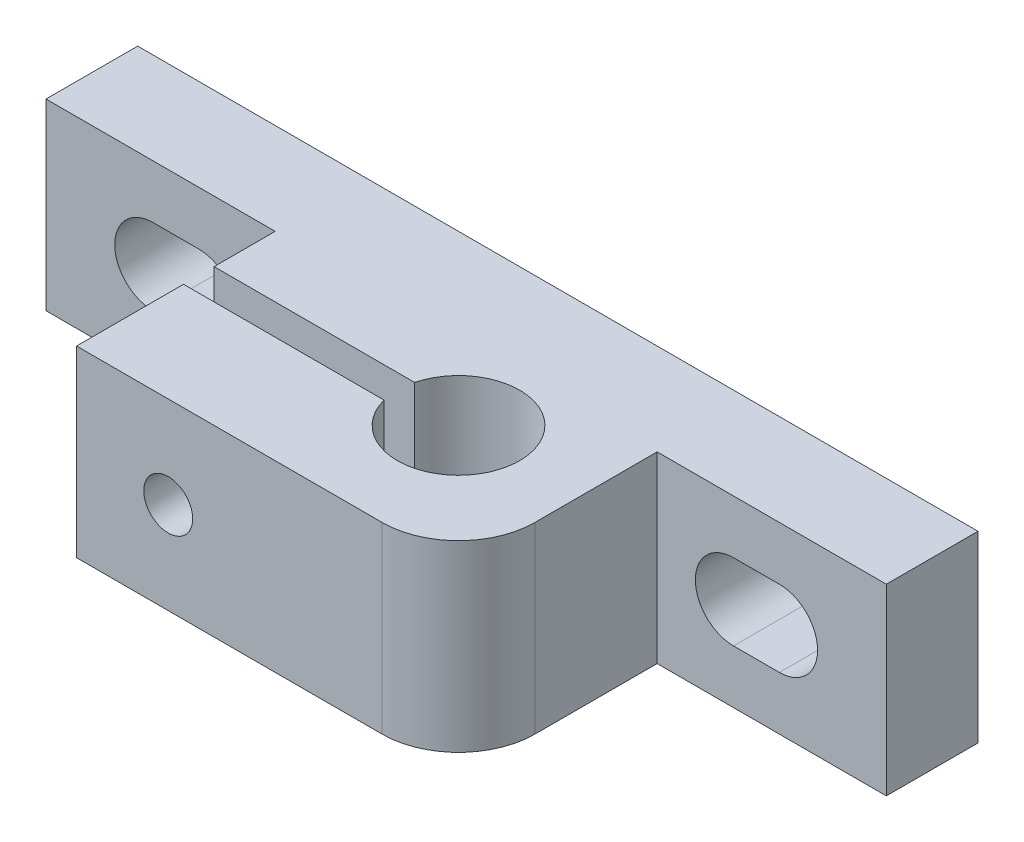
from build123d import *

# Parameters (mm, degrees)
SKETCH2_W           = 55
SKETCH2_H           = 12
BOSS_EXTRUDE1_DEPTH = 6
SKETCH3_W           = 25
SKETCH3_H           = 12
BOSS_EXTRUDE2_DEPTH = 13
FILLET1_R           = 5
SKETCH4_R           = 4
CUT_EXTRUDE2_DEPTH  = 30
SKETCH5_W           = 20.513890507
SKETCH5_H           = 7
CUT_EXTRUDE3_DEPTH  = 5
SKETCH6_R           = 1.6
CUT_EXTRUDE4_DEPTH  = 20
CUT_EXTRUDE5_DEPTH  = 3


with BuildPart() as part:
    # Sketch2 → Boss-Extrude1 (new body)
    with BuildSketch(Plane.XY):
        with Locations((27.5, 6)):
            Rectangle(SKETCH2_W, SKETCH2_H)
        with BuildLine():
            Line((7, 8.5), (10, 8.5))
            ThreePointArc((10, 8.5), (12.5, 6), (10, 3.5))
            Line((10, 3.5), (7, 3.5))
            ThreePointArc((7, 3.5), (4.5, 6), (7, 8.5))
        make_face(mode=Mode.SUBTRACT)
        with BuildLine():
            Line((48, 8.5), (45, 8.5))
            ThreePointArc((45, 8.5), (42.5, 6), (45, 3.5))
            Line((45, 3.5), (48, 3.5))
            ThreePointArc((48, 3.5), (50.5, 6), (48, 8.5))
        make_face(mode=Mode.SUBTRACT)
    extrude(amount=BOSS_EXTRUDE1_DEPTH)

    # Sketch3 → Boss-Extrude2 (add)
    with BuildSketch(Plane.XY.offset(6)):
        with Locations((27.5, 6)):
            Rectangle(SKETCH3_W, SKETCH3_H)
    extrude(amount=BOSS_EXTRUDE2_DEPTH)

    # Fillet1
    fillet1_edges = [part.edges().sort_by_distance(p)[0] for p in [
        (40, 6, 19),
    ]]
    fillet(fillet1_edges, radius=FILLET1_R)

    # Sketch4 → Cut-Extrude2 (cut)
    with BuildSketch(Plane.XZ):
        with BuildLine():
            ThreePointArc((28.127016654, 10), (28, 11), (28.127016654, 12))
            Line((28.127016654, 12), (15, 12))
            Line((15, 12), (15, 10))
            Line((15, 10), (28.127016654, 10))
        make_face()
        with Locations((32, 11)):
            Circle(SKETCH4_R)
    extrude(amount=-CUT_EXTRUDE2_DEPTH, mode=Mode.SUBTRACT)

    # Sketch5 → Cut-Extrude3 (cut)
    with BuildSketch(Plane(origin=(0, 0, 0), x_dir=(-1, 0, 0), z_dir=(0, 0, -1))):
        with Locations((-27.415473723, 6)):
            Rectangle(SKETCH5_W, SKETCH5_H)
    extrude(amount=-CUT_EXTRUDE3_DEPTH, mode=Mode.SUBTRACT)

    # Sketch6 → Cut-Extrude4 (cut)
    with BuildSketch(Plane.XY.offset(19)):
        with Locations(Location((21, 6, 0), (0, 0, 180))):
            Circle(SKETCH6_R)
    extrude(amount=-CUT_EXTRUDE4_DEPTH, mode=Mode.SUBTRACT)

    # Sketch7 → Cut-Extrude5 (cut)
    with BuildSketch(Plane(origin=(0, 0, 5), x_dir=(-1, 0, 0), z_dir=(0, 0, -1))):
        Polygon((-17.535898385, 6), (-19.267949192, 9), (-22.732050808, 9), (-24.464101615, 6), (-22.732050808, 3), (-19.267949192, 3), align=None)
    extrude(amount=-CUT_EXTRUDE5_DEPTH, mode=Mode.SUBTRACT)


solid = part.part
